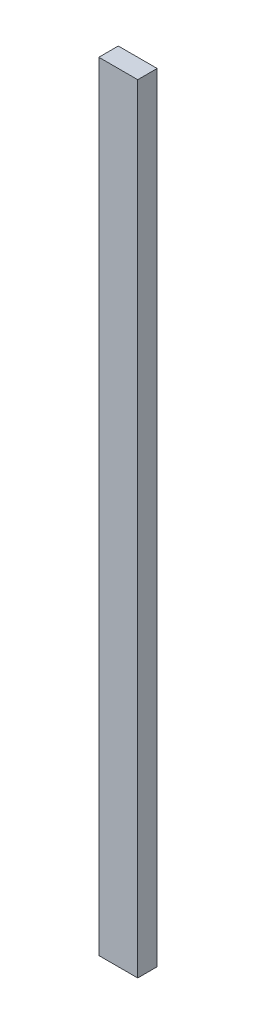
from build123d import *

# Parameters (mm, degrees)
SKETCH1_W           = 6.35
SKETCH1_H           = 127
BOSS_EXTRUDE1_DEPTH = 3.175


with BuildPart() as part:
    # Sketch1 → Boss-Extrude1 (new body)
    with BuildSketch(Plane.XY):
        with Locations((-36.248994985, -30.999243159)):
            Rectangle(SKETCH1_W, SKETCH1_H)
    extrude(amount=BOSS_EXTRUDE1_DEPTH)


solid = part.part
